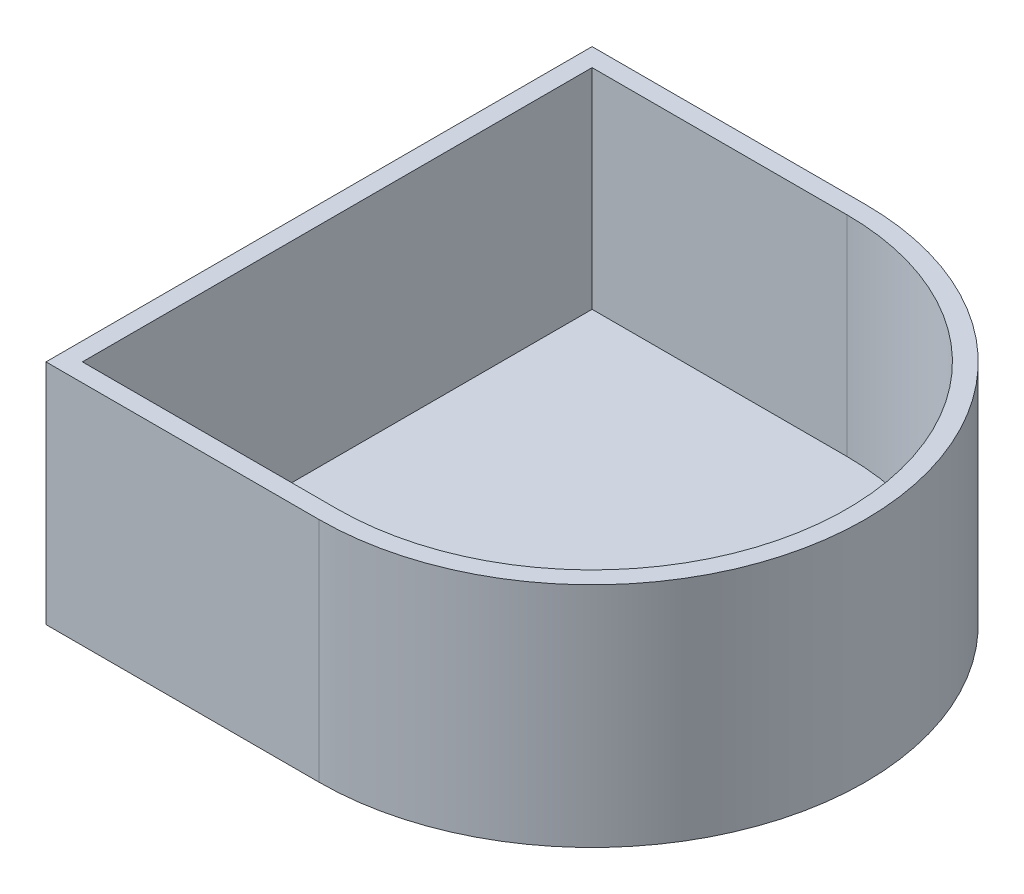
from build123d import *

# Parameters (mm, degrees)
BOSS_EXTRUDE1_DEPTH = 25
SHELL1_T            = -2


with BuildPart() as part:
    # Sketch1 → Boss-Extrude1 (new body)
    with BuildSketch(Plane(origin=(0, 0, 0), x_dir=(1, 0, 0), z_dir=(0, 1, 0))):
        with BuildLine():
            Line((-15, -30), (15, -30))
            ThreePointArc((15, -30), (45, 0), (15, 30))
            Line((15, 30), (-15, 30))
            Line((-15, 30), (-15, -30))
        make_face()
    extrude(amount=BOSS_EXTRUDE1_DEPTH)

    # Shell1
    shell1_openings = [part.faces().sort_by_distance(p)[0] for p in [
        (12.199504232, 25, 0),
    ]]
    offset(amount=SHELL1_T, openings=shell1_openings, kind=Kind.INTERSECTION)


solid = part.part
